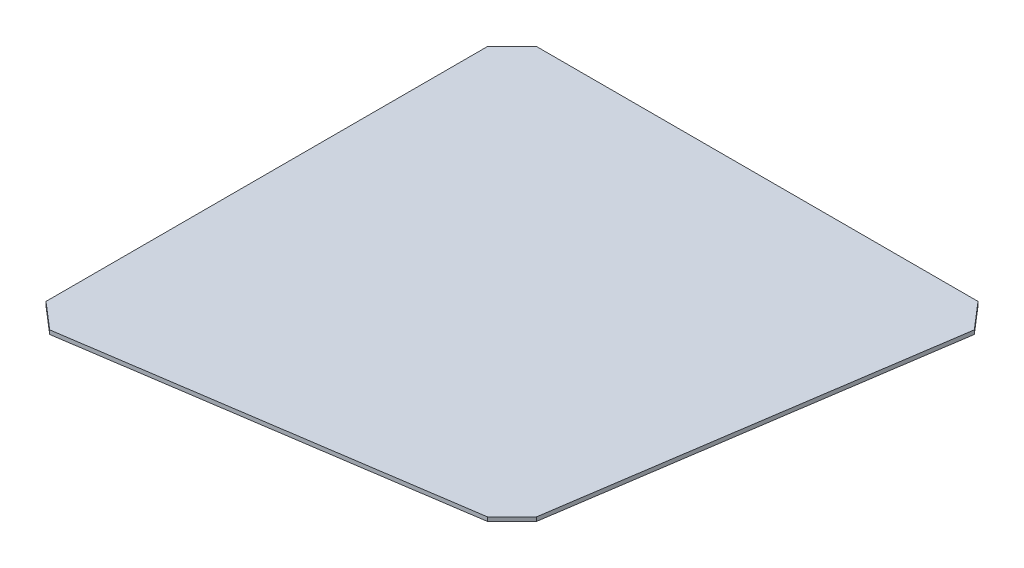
from build123d import *

# Parameters (mm, degrees)
SKETCH2_W           = 1212.85
SKETCH2_H           = 1212.85
BOSS_EXTRUDE1_DEPTH = 8.73125
SKETCH3_W           = 1.305737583
SKETCH3_H           = 8.73125
CUT_EXTRUDE1_DEPTH  = 1783.441668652
SKETCH4_W           = 1.305737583
SKETCH4_H           = 8.73125
CUT_EXTRUDE2_DEPTH  = 1782.636077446
CUT_EXTRUDE3_DEPTH  = 1527.11207336


with BuildPart() as part:
    # Sketch2 → Boss-Extrude1 (new body)
    with BuildSketch(Plane(origin=(0, 884.5296, 0), x_dir=(1, 0, 0), z_dir=(0, 1, 0))):
        with Locations((610.790625, -610.790625)):
            Rectangle(SKETCH2_W, SKETCH2_H)
    extrude(amount=-BOSS_EXTRUDE1_DEPTH)

    # SurfaceCut1
    split(bisect_by=Plane(origin=(173.49714204, 173.49714204, 1160.146525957), x_dir=(0.021639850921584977, -0.9892386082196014, 0.14470208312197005), z_dir=(-0.14631122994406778, -0.14631122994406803, -0.9783588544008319)), keep=Keep.TOP)

    # SurfaceCut2
    split(bisect_by=Plane(origin=(1160.146525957, 173.49714204, 173.49714204), x_dir=(-0.14470208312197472, -0.021639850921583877, 0.9892386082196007), z_dir=(-0.9783588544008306, -0.14631122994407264, -0.14631122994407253)), keep=Keep.TOP)

    # Sketch3 → Cut-Extrude1 (cut, through all, along a direction that is not the sketch's normal)
    with BuildSketch(Plane.ZY.offset(-4.365625)):
        with Locations((1079.759403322, 880.163975)):
            Rectangle(SKETCH3_W, SKETCH3_H)
    extrude(amount=-CUT_EXTRUDE1_DEPTH, dir=(-0.989001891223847, 0, 0.1479028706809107), mode=Mode.SUBTRACT)

    # Sketch4 → Cut-Extrude2 (cut, through all, along a direction that is not the sketch's normal)
    with BuildSketch(Plane(origin=(0, 0, 4.365625), x_dir=(-1, 0, 0), z_dir=(0, 0, -1))):
        with Locations((-1079.759403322, 880.163975)):
            Rectangle(SKETCH4_W, SKETCH4_H)
    extrude(amount=-CUT_EXTRUDE2_DEPTH, dir=(0.1479028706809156, 0, -0.9890018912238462), mode=Mode.SUBTRACT)

    # Sketch5 → Cut-Extrude3 (cut, through all)
    with BuildSketch(Plane(origin=(0, 884.5296, 0), x_dir=(1, 0, 0), z_dir=(0, 1, 0))):
        Polygon((4.365625, -58.247161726), (58.247161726, -4.365625), (4.365625, -4.365625), align=None)
        Polygon((4.365625, -1020.735764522), (62.09442693, -1070.473330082), (4.365625, -1079.10653453), align=None)
        Polygon((892.41877088, -946.300307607), (946.300307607, -892.41877088), (939.290719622, -939.290719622), align=None)
        Polygon((1020.735764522, -4.365625), (1070.473330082, -62.09442693), (1079.10653453, -4.365625), align=None)
    extrude(amount=-CUT_EXTRUDE3_DEPTH, mode=Mode.SUBTRACT)


solid = part.part
